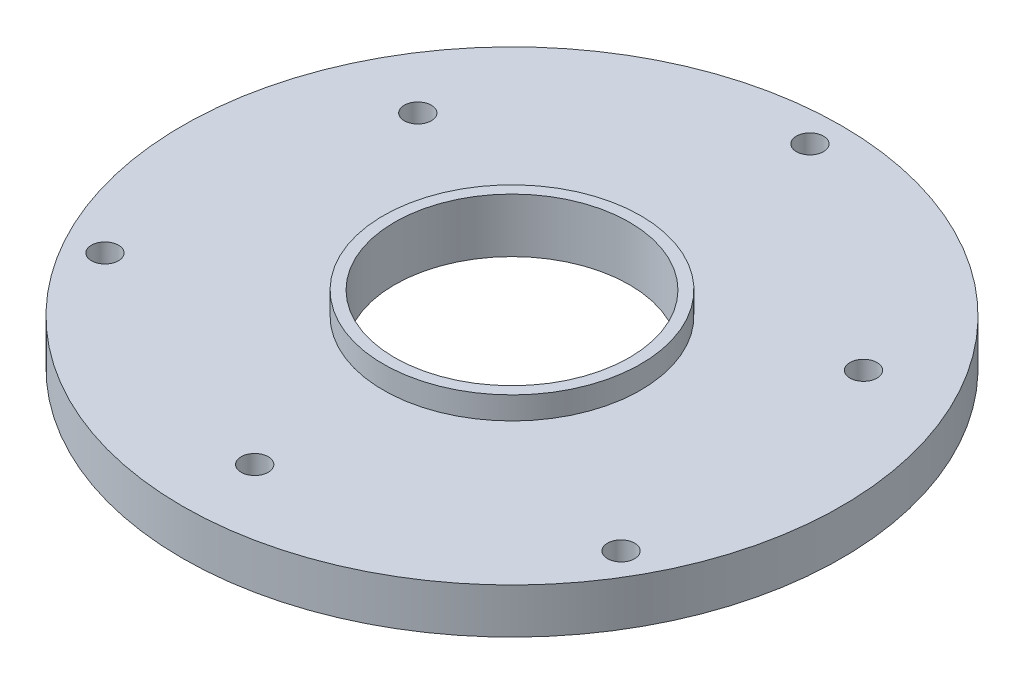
from build123d import *

# Parameters (mm, degrees)
SCHIZZO2_R               = 1.5
TAGLIO_ESTRUSIONE1_DEPTH = 52.860389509
SCHIZZO6_R               = 1.5
TAGLIO_ESTRUSIONE3_DEPTH = 53.160809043


with BuildPart() as part:
    # Schizzo1 → Rivoluzione1 (revolve)
    with BuildSketch(Plane.XY, mode=Mode.PRIVATE) as rivoluzione1_sk:
        Polygon((36.5, 39.385931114), (36.5, 34.385931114), (21, 34.385931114), (21, 35.885931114), (13, 35.885931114), (13, 41.885931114), (14.25, 41.885931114), (14.25, 39.385931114), align=None)
    revolve(rivoluzione1_sk.sketch.rotate(Axis((0, 0, 0), (0, 1, 0)), 90), axis=Axis((0, 0, 0), (0, 1, 0)))

    # Schizzo2 → Taglio-Estrusione1 (cut, through all)
    with BuildSketch(Plane(origin=(0, 39.385931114, 0), x_dir=(1, 0, 0), z_dir=(0, 1, 0))):
        with Locations(Location((0, 33, 0), (0, 0, 270))):
            Circle(SCHIZZO2_R)
        with Locations(Location((28.578838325, -16.5, 0), (0, 0, 270))):
            Circle(SCHIZZO2_R)
        with Locations(Location((-28.578838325, -16.5, 0), (0, 0, 270))):
            Circle(SCHIZZO2_R)
    extrude(amount=-TAGLIO_ESTRUSIONE1_DEPTH, mode=Mode.SUBTRACT)

    # Schizzo6 → Taglio-Estrusione3 (cut, through all)
    with BuildSketch(Plane(origin=(0, 34.385931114, 0), x_dir=(-1, 0, 0), z_dir=(0, -1, 0))):
        with Locations(Location((0, -28.5, 0), (0, 0, 90))):
            Circle(SCHIZZO6_R)
        with Locations(Location((-24.681724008, 14.25, 0), (0, 0, 90))):
            Circle(SCHIZZO6_R)
        with Locations(Location((24.681724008, 14.25, 0), (0, 0, 90))):
            Circle(SCHIZZO6_R)
    extrude(amount=-TAGLIO_ESTRUSIONE3_DEPTH, mode=Mode.SUBTRACT)


solid = part.part
